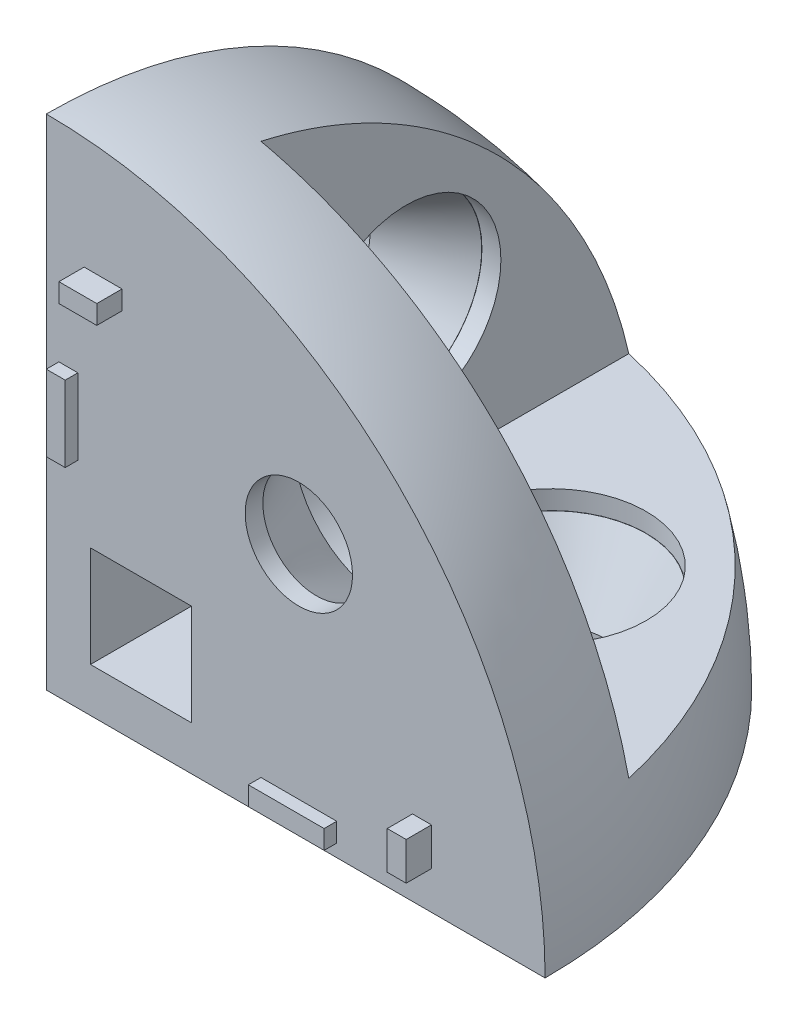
from build123d import *

# Parameters (mm, degrees)
REVOLVE_2_ANGLE     = 90
CUT_EXTRUDE_1_DEPTH = 64.886618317
SKETCH_3_R          = 4.25
CUT_EXTRUDE_2_DEPTH = 69.416006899
SKETCH_5_R          = 7.5
CUT_EXTRUDE_3_DEPTH = 1.5
CHAMFER_3_SIZE      = 5.6
CHAMFER_3_SIZE2     = 3.233161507
CHAMFER_4_SIZE      = 5.6
CHAMFER_4_SIZE2     = 3.233161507
CHAMFER_5_SIZE      = 5.6
CHAMFER_5_SIZE2     = 3.233161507
SKETCH_18_W         = 8
SKETCH_18_H         = 8
CUT_EXTRUDE_4_DEPTH = 11.5
SKETCH_19_W         = 1.5
SKETCH_19_H         = 6
SKETCH_19_W_2       = 6
SKETCH_19_H_2       = 1.5
EXTRUDE_1_DEPTH     = 1
SKETCH_21_W         = 3
SKETCH_21_H         = 1.5
SKETCH_21_W_2       = 1.5
SKETCH_21_H_2       = 3
EXTRUDE_2_DEPTH     = 2


with BuildPart() as part:
    # Sketch 1 → Revolve 2 (revolve)
    with BuildSketch(Plane.XY):
        with BuildLine():
            Line((0, 0), (0, 39.5))
            ThreePointArc((0, 39.5), (27.930717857, 27.930717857), (39.5, 0))
            Line((39.5, 0), (0, 0))
        make_face()
    revolve(axis=Axis((0, 0, 0), (0, 1, 0)), revolution_arc=REVOLVE_2_ANGLE)

    # Sketch 2 → Cut-Extrude 1 (cut, through all)
    with BuildSketch(Plane.XY.offset(-8.5)):
        Polygon((8.5, 38.65139504), (8.5, 8.5), (40.109340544, 8.5), (36.649276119, 40.725998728), align=None)
    extrude(amount=-CUT_EXTRUDE_1_DEPTH, mode=Mode.SUBTRACT)

    # Sketch 3 → Cut-Extrude 2 (cut, through all)
    with BuildSketch(Plane.XY):
        with Locations((20, 20)):
            Circle(SKETCH_3_R)
    cut_extrude_2 = extrude(amount=-CUT_EXTRUDE_2_DEPTH, mode=Mode.SUBTRACT)

    # Sketch 5 → Cut-Extrude 3 (cut)
    with BuildSketch(Plane.XY.offset(-8.5)):
        with Locations((20, 20)):
            Circle(SKETCH_5_R)
    cut_extrude_3 = extrude(amount=CUT_EXTRUDE_3_DEPTH, mode=Mode.SUBTRACT)

    # Mirror 3: Cut-Extrude 2, Cut-Extrude 3 across plane
    add(cut_extrude_2.mirror(Plane(origin=(0, 0, 0), x_dir=(-0.7071067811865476, 0, 0.7071067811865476), z_dir=(-0.7071067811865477, 0, -0.7071067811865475))), mode=Mode.SUBTRACT)
    add(cut_extrude_3.mirror(Plane(origin=(0, 0, 0), x_dir=(-0.7071067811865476, 0, 0.7071067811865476), z_dir=(-0.7071067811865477, 0, -0.7071067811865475))), mode=Mode.SUBTRACT)

    # Mirror 4: Cut-Extrude 2, Cut-Extrude 3 across plane
    add(cut_extrude_2.mirror(Plane(origin=(0, 0, 0), x_dir=(0, -0.7071067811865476, 0.7071067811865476), z_dir=(0, 0.7071067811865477, 0.7071067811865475))), mode=Mode.SUBTRACT)
    add(cut_extrude_3.mirror(Plane(origin=(0, 0, 0), x_dir=(0, -0.7071067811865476, 0.7071067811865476), z_dir=(0, 0.7071067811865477, 0.7071067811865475))), mode=Mode.SUBTRACT)

    # Chamfer 3
    chamfer_3_edges = [part.edges().sort_by_distance(p)[0] for p in [
        (15.75, 20, -7),
    ]]
    chamfer_3_side = [part.faces().sort_by_distance(p)[0] for p in [
        (15.75, 20, -3.5),
    ]]
    chamfer(chamfer_3_edges, length=CHAMFER_3_SIZE, length2=CHAMFER_3_SIZE2, reference=chamfer_3_side[0])

    # Chamfer 4
    chamfer_4_edges = [part.edges().sort_by_distance(p)[0] for p in [
        (15.75, 7, -20),
    ]]
    chamfer_4_side = [part.faces().sort_by_distance(p)[0] for p in [
        (15.75, 3.5, -20),
    ]]
    chamfer(chamfer_4_edges, length=CHAMFER_4_SIZE, length2=CHAMFER_4_SIZE2, reference=chamfer_4_side[0])

    # Chamfer 5
    chamfer_5_edges = [part.edges().sort_by_distance(p)[0] for p in [
        (7, 20, -15.75),
    ]]
    chamfer_5_side = [part.faces().sort_by_distance(p)[0] for p in [
        (3.5, 20, -15.75),
    ]]
    chamfer(chamfer_5_edges, length=CHAMFER_5_SIZE, length2=CHAMFER_5_SIZE2, reference=chamfer_5_side[0])

    # Sketch 18 → Cut-Extrude 4 (cut)
    with BuildSketch(Plane.XY):
        with Locations((7.5, 7.5)):
            Rectangle(SKETCH_18_W, SKETCH_18_H)
    extrude(amount=-CUT_EXTRUDE_4_DEPTH, mode=Mode.SUBTRACT)

    # Sketch 19 → Extrude 1 (add)
    with BuildSketch(Plane.XY):
        with Locations((1.75, 20)):
            Rectangle(SKETCH_19_W, SKETCH_19_H)
        with Locations((20, 1.75)):
            Rectangle(SKETCH_19_W_2, SKETCH_19_H_2)
    extrude_1 = extrude(amount=EXTRUDE_1_DEPTH)

    # Sketch 21 → Extrude 2 (add)
    with BuildSketch(Plane.XY):
        with Locations((4.5, 29.75)):
            Rectangle(SKETCH_21_W, SKETCH_21_H)
        with Locations((29.75, 4.5)):
            Rectangle(SKETCH_21_W_2, SKETCH_21_H_2)
    extrude_2 = extrude(amount=EXTRUDE_2_DEPTH)

    # Mirror 5: Extrude 1, Extrude 2 across plane
    add(extrude_1.mirror(Plane(origin=(0, 0, 0), x_dir=(0, -0.7071067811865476, 0.7071067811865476), z_dir=(0, 0.7071067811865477, 0.7071067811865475))))
    add(extrude_2.mirror(Plane(origin=(0, 0, 0), x_dir=(0, -0.7071067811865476, 0.7071067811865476), z_dir=(0, 0.7071067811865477, 0.7071067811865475))))

    # Mirror 6: Extrude 1, Extrude 2 across plane
    add(extrude_1.mirror(Plane(origin=(0, 0, 0), x_dir=(-0.7071067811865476, 0, 0.7071067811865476), z_dir=(-0.7071067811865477, 0, -0.7071067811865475))))
    add(extrude_2.mirror(Plane(origin=(0, 0, 0), x_dir=(-0.7071067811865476, 0, 0.7071067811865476), z_dir=(-0.7071067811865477, 0, -0.7071067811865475))))


solid = part.part
